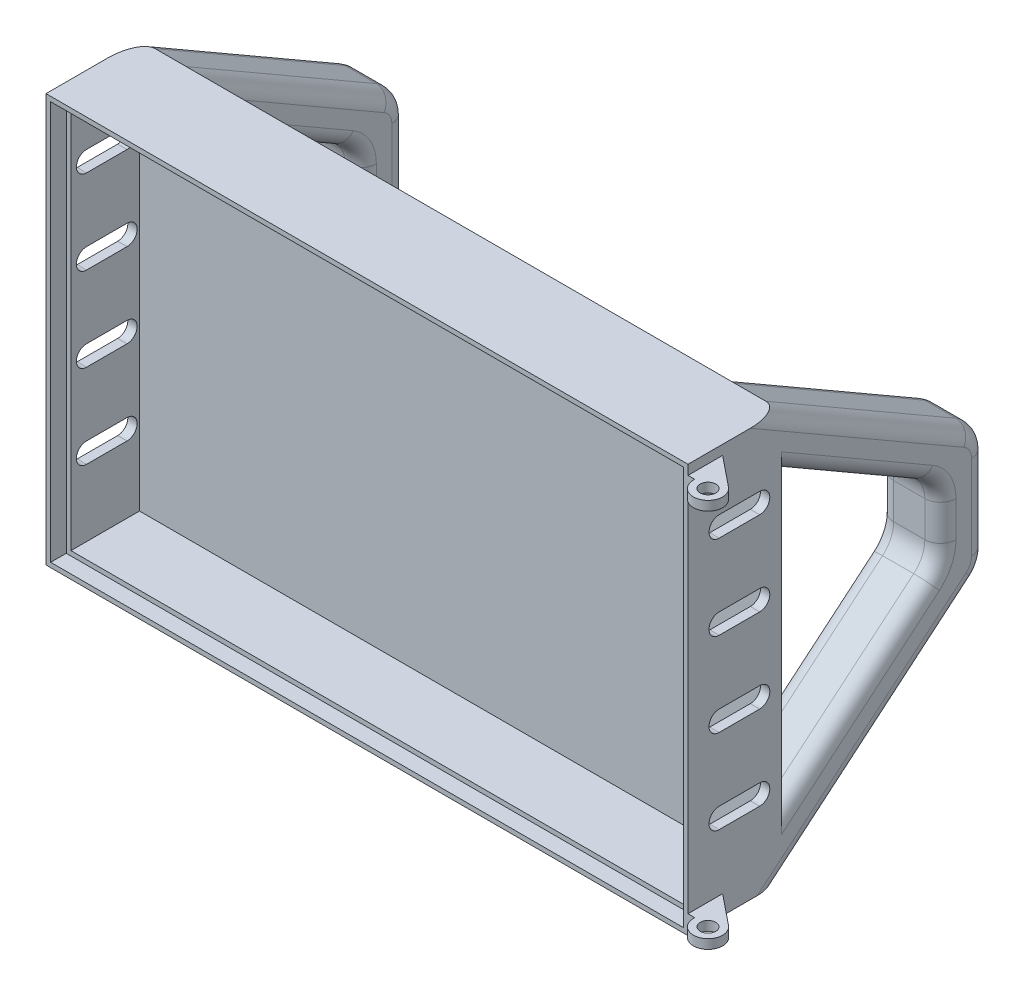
from build123d import *

# Parameters (mm, degrees)
SKETCH1_W           = 206
SKETCH1_H           = 131
BOSS_EXTRUDE1_DEPTH = 30
SHELL1_T            = -3
BOSS_EXTRUDE2_DEPTH = 20
BOSS_EXTRUDE3_START = -20
BOSS_EXTRUDE3_DEPTH = 20
FILLET1_R           = 5
FILLET2_R           = 5
SKETCH5_W           = 203
SKETCH5_H           = 128
SKETCH5_W_2         = 200
SKETCH5_H_2         = 125
CUT_EXTRUDE1_DEPTH  = 5
BOSS_EXTRUDE4_START = -3.1
SKETCH6_R           = 2.5
BOSS_EXTRUDE4_DEPTH = 3
BOSS_EXTRUDE5_START = -6.1
SKETCH7_R           = 2.5
BOSS_EXTRUDE5_DEPTH = 3
CUT_EXTRUDE2_DEPTH  = 230
SKETCH9_W           = 1.549267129
SKETCH9_H           = 11.181551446
CUT_EXTRUDE3_DEPTH  = 0.5
CHAMFER1_SIZE       = 0.3
FILLET3_R           = 0.1


with BuildPart() as part:
    # Sketch1 → Boss-Extrude1 (new body)
    with BuildSketch(Plane.XY):
        with Locations((0, 65.5)):
            Rectangle(SKETCH1_W, SKETCH1_H)
    extrude(amount=BOSS_EXTRUDE1_DEPTH)

    # Shell1
    shell1_openings = [part.faces().sort_by_distance(p)[0] for p in [
        (0, 65.5, 30),
    ]]
    offset(amount=SHELL1_T, openings=shell1_openings, kind=Kind.INTERSECTION)

    # Sketch3 → Boss-Extrude2 (add)
    with BuildSketch(Plane.ZY.offset(103)):
        with BuildLine():
            Line((0, 19.58110934), (0, 0))
            Line((0, 0), (-62.427876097, 52.383207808))
            ThreePointArc((-62.427876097, 52.383207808), (-65.06307787, 55.817469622), (-66, 60.043652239))
            Line((-66, 60.043652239), (-66, 87.121379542))
            ThreePointArc((-66, 87.121379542), (-64.660254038, 92.121379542), (-61, 95.781633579))
            Line((-61, 95.781633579), (0, 131))
            Line((0, 131), (0, 113.679491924))
            Line((0, 113.679491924), (-46, 87.121379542))
            ThreePointArc((-46, 87.121379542), (-49.660254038, 83.461125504), (-51, 78.461125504))
            Line((-51, 78.461125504), (-51, 67.038267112))
            ThreePointArc((-51, 67.038267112), (-50.06307787, 62.812084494), (-47.427876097, 59.37782268))
            Line((-47.427876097, 59.37782268), (0, 19.58110934))
        make_face()
    extrude(amount=-BOSS_EXTRUDE2_DEPTH)

    # Sketch4 → Boss-Extrude3 (add)
    with BuildSketch(Plane(origin=(103, 0, 0), x_dir=(0, 0, -1), z_dir=(1, 0, 0)).offset(BOSS_EXTRUDE3_START)):
        with BuildLine():
            Line((0, 0), (62.427876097, 52.383207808))
            ThreePointArc((62.427876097, 52.383207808), (65.06307787, 55.817469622), (66, 60.043652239))
            Line((66, 60.043652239), (66, 87.121379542))
            ThreePointArc((66, 87.121379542), (64.660254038, 92.121379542), (61, 95.781633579))
            Line((61, 95.781633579), (0, 131))
            Line((0, 131), (0, 113.679491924))
            Line((0, 113.679491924), (46, 87.121379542))
            ThreePointArc((46, 87.121379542), (49.660254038, 83.461125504), (51, 78.461125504))
            Line((51, 78.461125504), (51, 67.038267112))
            ThreePointArc((51, 67.038267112), (50.06307787, 62.812084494), (47.427876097, 59.37782268))
            Line((47.427876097, 59.37782268), (0, 19.58110934))
            Line((0, 19.58110934), (0, 0))
        make_face()
    extrude(amount=BOSS_EXTRUDE3_DEPTH)

    # Fillet1
    fillet1_edges = [part.edges().sort_by_distance(p)[0] for p in [
        (-83, 26.191603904, -31.213938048),
        (-83, 55.817469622, -65.06307787),
        (-83, 73.58251589, -66),
        (-83, 92.121379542, -64.660254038),
        (-83, 113.39081679, -30.5),
        (-103, 26.191603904, -31.213938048),
        (-103, 113.39081679, -30.5),
        (-103, 92.121379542, -64.660254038),
        (-103, 73.58251589, -66),
        (-103, 55.817469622, -65.06307787),
        (83, 113.39081679, -30.5),
        (83, 92.121379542, -64.660254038),
        (83, 73.58251589, -66),
        (83, 55.817469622, -65.06307787),
        (83, 26.191603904, -31.213938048),
        (103, 26.191603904, -31.213938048),
        (103, 55.817469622, -65.06307787),
        (103, 73.58251589, -66),
        (103, 92.121379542, -64.660254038),
        (103, 113.39081679, -30.5),
    ]]
    fillet(fillet1_edges, radius=FILLET1_R)

    # Fillet2
    fillet2_edges = [part.edges().sort_by_distance(p)[0] for p in [
        (-83, 100.400435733, -23),
        (-83, 83.461125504, -49.660254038),
        (-83, 72.749696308, -51),
        (-83, 62.812084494, -50.06307787),
        (-83, 39.47946601, -23.713938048),
        (-103, 39.47946601, -23.713938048),
        (-103, 62.812084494, -50.06307787),
        (-103, 72.749696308, -51),
        (-103, 83.461125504, -49.660254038),
        (-103, 100.400435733, -23),
        (83, 39.47946601, -23.713938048),
        (83, 62.812084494, -50.06307787),
        (83, 72.749696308, -51),
        (83, 83.461125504, -49.660254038),
        (83, 100.400435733, -23),
        (103, 100.400435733, -23),
        (103, 83.461125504, -49.660254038),
        (103, 72.749696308, -51),
        (103, 62.812084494, -50.06307787),
        (103, 39.47946601, -23.713938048),
    ]]
    fillet(fillet2_edges, radius=FILLET2_R)

    # Sketch5 → Cut-Extrude1 (cut)
    with BuildSketch(Plane.XY.offset(30)):
        with Locations((0, 65.5)):
            Rectangle(SKETCH5_W, SKETCH5_H)
        with Locations((0, 65.5)):
            Rectangle(SKETCH5_W_2, SKETCH5_H_2, mode=Mode.SUBTRACT)
    extrude(amount=-CUT_EXTRUDE1_DEPTH, mode=Mode.SUBTRACT)

    # Sketch6 → Boss-Extrude4 (add)
    with BuildSketch(Plane.XZ.offset(BOSS_EXTRUDE4_START)):
        with BuildLine():
            Line((103, 18.889309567), (112.788567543, 26.786092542))
            ThreePointArc((112.788567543, 26.786092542), (111.869945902, 34.640539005), (105.18, 30.423808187))
            Line((105.18, 30.423808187), (105.18, 30))
            Line((105.18, 30), (103, 30))
            Line((103, 30), (103, 18.889309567))
        make_face()
        with Locations((109.853893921, 30.423808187)):
            Circle(SKETCH6_R, mode=Mode.SUBTRACT)
    extrude(amount=-BOSS_EXTRUDE4_DEPTH)

    # Sketch7 → Boss-Extrude5 (add)
    with BuildSketch(Plane(origin=(0, 131, 0), x_dir=(1, 0, 0), z_dir=(0, 1, 0)).offset(BOSS_EXTRUDE5_START)):
        with BuildLine():
            Line((112.788567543, -26.786092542), (103, -18.889309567))
            Line((103, -18.889309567), (103, -30))
            Line((103, -30), (105.18, -30))
            Line((105.18, -30), (105.18, -30.423808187))
            ThreePointArc((105.18, -30.423808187), (111.869945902, -34.640539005), (112.788567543, -26.786092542))
        make_face()
        with Locations((109.853893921, -30.423808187)):
            Circle(SKETCH7_R, mode=Mode.SUBTRACT)
    extrude(amount=BOSS_EXTRUDE5_DEPTH)

    # Sketch8 → Cut-Extrude2 (cut)
    with BuildSketch(Plane.ZY.offset(103)):
        with BuildLine():
            Line((7, 111.971350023), (20, 111.971350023))
            ThreePointArc((20, 111.971350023), (23.25, 108.721350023), (20, 105.471350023))
            Line((20, 105.471350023), (7, 105.471350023))
            ThreePointArc((7, 105.471350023), (3.75, 108.721350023), (7, 111.971350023))
        make_face()
        with BuildLine():
            Line((7, 84.971350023), (20, 84.971350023))
            ThreePointArc((20, 84.971350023), (23.25, 81.721350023), (20, 78.471350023))
            Line((20, 78.471350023), (7, 78.471350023))
            ThreePointArc((7, 78.471350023), (3.75, 81.721350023), (7, 84.971350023))
        make_face()
        with BuildLine():
            Line((7, 57.971350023), (20, 57.971350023))
            ThreePointArc((20, 57.971350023), (23.25, 54.721350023), (20, 51.471350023))
            Line((20, 51.471350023), (7, 51.471350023))
            ThreePointArc((7, 51.471350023), (3.75, 54.721350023), (7, 57.971350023))
        make_face()
        with BuildLine():
            Line((7, 30.971350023), (20, 30.971350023))
            ThreePointArc((20, 30.971350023), (23.25, 27.721350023), (20, 24.471350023))
            Line((20, 24.471350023), (7, 24.471350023))
            ThreePointArc((7, 24.471350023), (3.75, 27.721350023), (7, 30.971350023))
        make_face()
    extrude(amount=-CUT_EXTRUDE2_DEPTH, mode=Mode.SUBTRACT)

    # Sketch9 → Cut-Extrude3 (cut)
    with BuildSketch(Plane.ZY.offset(103)):
        with Locations((22.351210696, 65.043490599)):
            Rectangle(SKETCH9_W, SKETCH9_H)
    extrude(amount=-CUT_EXTRUDE3_DEPTH, mode=Mode.SUBTRACT)

    # Chamfer1
    chamfer1_edges = [part.edges().sort_by_distance(p)[0] for p in [
        (-103, 65.043490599, 21.576577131),
    ]]
    chamfer(chamfer1_edges, length=CHAMFER1_SIZE)

    # Fillet3
    fillet3_edges = [part.edges().sort_by_distance(p)[0] for p in [
        (-103, 65.043490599, 23.12584426),
    ]]
    fillet(fillet3_edges, radius=FILLET3_R)


solid = part.part
